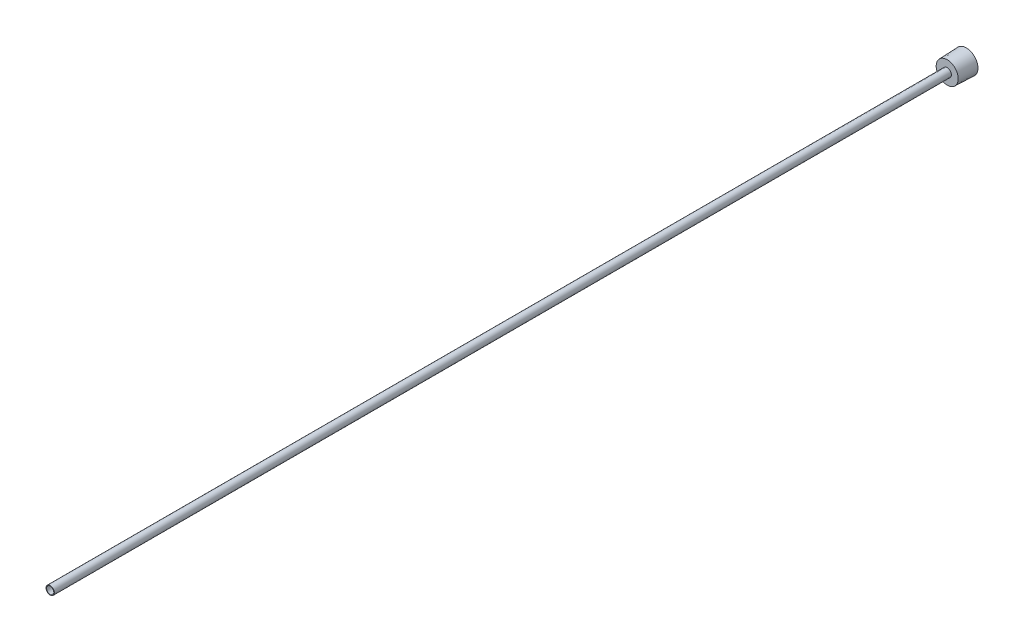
from build123d import *

# Parameters (mm, degrees)
SKETCH2_R          = 1.2065
CUT_EXTRUDE1_DEPTH = 305.84986935
CUT_EXTRUDE2_DEPTH = 3.96875


with BuildPart() as part:
    # Sketch1 → Revolve1 (revolve)
    with BuildSketch(Plane(origin=(0, 0, 0), x_dir=(0, 0, -1), z_dir=(1, 0, 0)), mode=Mode.PRIVATE) as revolve1_sk:
        Polygon((-304.8, 0), (0, 0), (0, 3.8989), (-6.35, 3.667387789), (-6.35, 1.3890625), (-304.8, 1.3890625), align=None)
    revolve(revolve1_sk.sketch.rotate(Axis((0, 0, 0), (0, 0, -1)), 90), axis=Axis((0, 0, 0), (0, 0, -1)))

    # Sketch2 → Cut-Extrude1 (cut, through all)
    with BuildSketch(Plane.XY.offset(304.8)):
        Circle(SKETCH2_R)
    extrude(amount=-CUT_EXTRUDE1_DEPTH, mode=Mode.SUBTRACT)

    # Sketch3 → Cut-Extrude2 (cut)
    with BuildSketch(Plane(origin=(0, 0, 0), x_dir=(-1, 0, 0), z_dir=(0, 0, -1))):
        Polygon((0, -2.756963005), (2.3876, -1.378481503), (2.3876, 1.378481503), (0, 2.756963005), (-2.3876, 1.378481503), (-2.3876, -1.378481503), align=None)
    extrude(amount=-CUT_EXTRUDE2_DEPTH, mode=Mode.SUBTRACT)


solid = part.part
